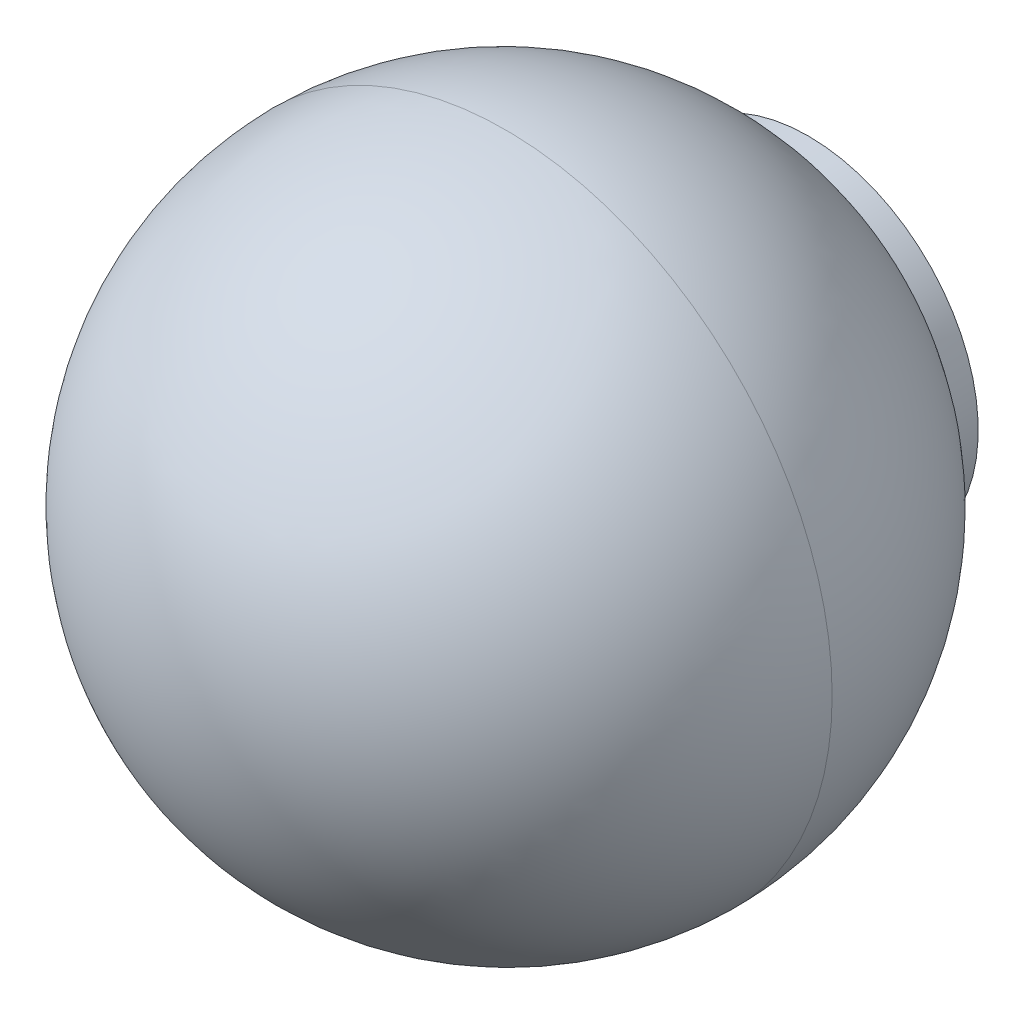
ISO-10303-21;
HEADER;
FILE_DESCRIPTION(('STEP AP214'),'2;1');
FILE_NAME('part.step','',(''),(''),'','','');
FILE_SCHEMA(('AUTOMOTIVE_DESIGN { 1 0 10303 214 1 1 1 1 }'));
ENDSEC;
DATA;
#1=APPLICATION_CONTEXT('core data for automotive mechanical design processes');
#2=APPLICATION_PROTOCOL_DEFINITION('international standard','automotive_design',2000,#1);
#3=PRODUCT_CONTEXT('',#1,'mechanical');
#4=PRODUCT('Part','Part','',(#3));
#5=PRODUCT_RELATED_PRODUCT_CATEGORY('part','',(#4));
#6=PRODUCT_DEFINITION_FORMATION('','',#4);
#7=PRODUCT_DEFINITION_CONTEXT('part definition',#1,'design');
#8=PRODUCT_DEFINITION('design','',#6,#7);
#9=PRODUCT_DEFINITION_SHAPE('','',#8);
#10=(LENGTH_UNIT() NAMED_UNIT(*) SI_UNIT(.MILLI.,.METRE.));
#11=(NAMED_UNIT(*) PLANE_ANGLE_UNIT() SI_UNIT($,.RADIAN.));
#12=(NAMED_UNIT(*) SI_UNIT($,.STERADIAN.) SOLID_ANGLE_UNIT());
#13=UNCERTAINTY_MEASURE_WITH_UNIT(LENGTH_MEASURE(1.E-05),#10,'distance_accuracy_value','');
#14=(GEOMETRIC_REPRESENTATION_CONTEXT(3) GLOBAL_UNCERTAINTY_ASSIGNED_CONTEXT((#13)) GLOBAL_UNIT_ASSIGNED_CONTEXT((#10,
#11,#12)) REPRESENTATION_CONTEXT('',''));
#15=CARTESIAN_POINT('',(0.,0.,0.));
#16=DIRECTION('',(0.,0.,1.));
#17=DIRECTION('',(1.,0.,0.));
#18=AXIS2_PLACEMENT_3D('',#15,#16,#17);
#19=CARTESIAN_POINT('',(0.,0.,23.));
#20=DIRECTION('',(0.,0.,-1.));
#21=DIRECTION('',(1.,0.,0.));
#22=AXIS2_PLACEMENT_3D('',#19,#20,#21);
#23=SPHERICAL_SURFACE('',#22,25.);
#24=CARTESIAN_POINT('',(0.,0.,23.1770782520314));
#25=DIRECTION('',(0.,0.,-1.));
#26=DIRECTION('',(0.,1.,0.));
#27=AXIS2_PLACEMENT_3D('',#24,#25,#26);
#28=CIRCLE('',#27,24.999372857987);
#29=CARTESIAN_POINT('',(24.999372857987,0.,23.1770782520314));
#30=VERTEX_POINT('',#29);
#31=EDGE_CURVE('E22',#30,#30,#28,.T.);
#32=ORIENTED_EDGE('',*,*,#31,.F.);
#33=EDGE_LOOP('',(#32));
#34=FACE_BOUND('',#33,.T.);
#35=ADVANCED_FACE('F12',(#34),#23,.T.);
#36=CARTESIAN_POINT('',(0.,0.,0.));
#37=DIRECTION('',(0.,0.,-1.));
#38=DIRECTION('',(0.,1.,0.));
#39=AXIS2_PLACEMENT_3D('',#36,#37,#38);
#40=PLANE('',#39);
#41=CARTESIAN_POINT('',(0.,0.,0.));
#42=DIRECTION('',(0.,0.,-1.));
#43=DIRECTION('',(0.,1.,0.));
#44=AXIS2_PLACEMENT_3D('',#41,#42,#43);
#45=CIRCLE('',#44,8.);
#46=CARTESIAN_POINT('',(0.,8.,0.));
#47=VERTEX_POINT('',#46);
#48=EDGE_CURVE('E31',#47,#47,#45,.T.);
#49=ORIENTED_EDGE('',*,*,#48,.F.);
#50=EDGE_LOOP('',(#49));
#51=FACE_BOUND('',#50,.T.);
#52=CARTESIAN_POINT('',(0.,0.,0.));
#53=DIRECTION('',(0.,0.,-1.));
#54=DIRECTION('',(0.,1.,0.));
#55=AXIS2_PLACEMENT_3D('',#52,#53,#54);
#56=CIRCLE('',#55,13.);
#57=CARTESIAN_POINT('',(0.,13.,0.));
#58=VERTEX_POINT('',#57);
#59=EDGE_CURVE('E8',#58,#58,#56,.T.);
#60=ORIENTED_EDGE('',*,*,#59,.T.);
#61=EDGE_LOOP('',(#60));
#62=FACE_BOUND('',#61,.T.);
#63=ADVANCED_FACE('F37',(#51,#62),#40,.T.);
#64=CARTESIAN_POINT('',(0.,0.,0.));
#65=DIRECTION('',(0.,0.,-1.));
#66=DIRECTION('',(0.,1.,0.));
#67=AXIS2_PLACEMENT_3D('',#64,#65,#66);
#68=CYLINDRICAL_SURFACE('',#67,13.);
#69=CARTESIAN_POINT('',(0.,0.,2.));
#70=DIRECTION('',(0.,0.,-1.));
#71=DIRECTION('',(0.,1.,0.));
#72=AXIS2_PLACEMENT_3D('',#69,#70,#71);
#73=CIRCLE('',#72,13.);
#74=CARTESIAN_POINT('',(13.,0.,2.));
#75=VERTEX_POINT('',#74);
#76=EDGE_CURVE('E18',#75,#75,#73,.T.);
#77=ORIENTED_EDGE('',*,*,#76,.T.);
#78=EDGE_LOOP('',(#77));
#79=FACE_BOUND('',#78,.T.);
#80=ORIENTED_EDGE('',*,*,#59,.F.);
#81=EDGE_LOOP('',(#80));
#82=FACE_BOUND('',#81,.T.);
#83=ADVANCED_FACE('F39',(#79,#82),#68,.T.);
#84=CARTESIAN_POINT('',(0.,0.,23.3541565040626));
#85=DIRECTION('',(0.,0.,-1.));
#86=DIRECTION('',(1.,0.,0.));
#87=AXIS2_PLACEMENT_3D('',#84,#85,#86);
#88=SPHERICAL_SURFACE('',#87,25.);
#89=CARTESIAN_POINT('',(24.999372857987,0.,23.1770782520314));
#90=CARTESIAN_POINT('',(24.997498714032,0.,22.9122769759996));
#91=CARTESIAN_POINT('',(24.9914142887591,0.,22.6475056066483));
#92=CARTESIAN_POINT('',(24.9708377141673,0.,22.1182897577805));
#93=CARTESIAN_POINT('',(24.9563455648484,0.,21.853845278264));
#94=CARTESIAN_POINT('',(24.9189663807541,0.,21.3255502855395));
#95=CARTESIAN_POINT('',(24.8960793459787,0.,21.0616997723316));
#96=CARTESIAN_POINT('',(24.841933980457,0.,20.5348591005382));
#97=CARTESIAN_POINT('',(24.8106756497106,0.,20.2718689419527));
#98=CARTESIAN_POINT('',(24.7398191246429,0.,19.7470145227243));
#99=CARTESIAN_POINT('',(24.7002209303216,0.,19.4851502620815));
#100=CARTESIAN_POINT('',(24.6127246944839,0.,18.962812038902));
#101=CARTESIAN_POINT('',(24.5648266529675,0.,18.7023380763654));
#102=CARTESIAN_POINT('',(24.4607790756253,0.,18.1830434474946));
#103=CARTESIAN_POINT('',(24.4046295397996,0.,17.9242227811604));
#104=CARTESIAN_POINT('',(24.2841356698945,0.,17.4084960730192));
#105=CARTESIAN_POINT('',(24.219791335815,0.,17.1515900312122));
#106=CARTESIAN_POINT('',(24.0829728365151,0.,16.6399519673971));
#107=CARTESIAN_POINT('',(24.0104986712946,0.,16.385219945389));
#108=CARTESIAN_POINT('',(23.8574936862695,0.,15.8781871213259));
#109=CARTESIAN_POINT('',(23.7769628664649,0.,15.625886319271));
#110=CARTESIAN_POINT('',(23.6079258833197,0.,15.1239706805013));
#111=CARTESIAN_POINT('',(23.5194197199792,0.,14.8743558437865));
#112=CARTESIAN_POINT('',(23.3345214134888,0.,14.3780641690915));
#113=CARTESIAN_POINT('',(23.2381292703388,0.,14.1313873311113));
#114=CARTESIAN_POINT('',(23.0375563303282,0.,13.6412207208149));
#115=CARTESIAN_POINT('',(22.9333755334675,0.,13.3977309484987));
#116=CARTESIAN_POINT('',(22.7173304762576,0.,12.9141843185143));
#117=CARTESIAN_POINT('',(22.6054662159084,0.,12.6741274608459));
#118=CARTESIAN_POINT('',(22.3741671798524,0.,12.1976890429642));
#119=CARTESIAN_POINT('',(22.2547324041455,0.,11.9613074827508));
#120=CARTESIAN_POINT('',(22.0084129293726,0.,11.492458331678));
#121=CARTESIAN_POINT('',(21.8815282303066,0.,11.2599907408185));
#122=CARTESIAN_POINT('',(21.6204370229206,0.,10.7992042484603));
#123=CARTESIAN_POINT('',(21.4862305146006,0.,10.5708853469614));
#124=CARTESIAN_POINT('',(21.2106311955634,0.,10.1186267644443));
#125=CARTESIAN_POINT('',(21.0692383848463,0.,9.89468708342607));
#126=CARTESIAN_POINT('',(20.779409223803,0.,9.45141305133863));
#127=CARTESIAN_POINT('',(20.6309728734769,0.,9.23207870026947));
#128=CARTESIAN_POINT('',(20.3272065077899,0.,8.79823678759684));
#129=CARTESIAN_POINT('',(20.1718764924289,0.,8.58372922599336));
#130=CARTESIAN_POINT('',(19.8544796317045,0.,8.15975747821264));
#131=CARTESIAN_POINT('',(19.692412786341,0.,7.95029329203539));
#132=CARTESIAN_POINT('',(19.3617059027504,0.,7.53661978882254));
#133=CARTESIAN_POINT('',(19.1930658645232,0.,7.33241047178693));
#134=CARTESIAN_POINT('',(18.8493828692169,0.,6.9294528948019));
#135=CARTESIAN_POINT('',(18.6743399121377,0.,6.73070463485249));
#136=CARTESIAN_POINT('',(18.3180278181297,0.,6.33886984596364));
#137=CARTESIAN_POINT('',(18.136758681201,0.,6.14578331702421));
#138=CARTESIAN_POINT('',(17.7681772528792,0.,5.76546694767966));
#139=CARTESIAN_POINT('',(17.5808649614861,0.,5.57823710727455));
#140=CARTESIAN_POINT('',(17.2003863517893,0.,5.20982315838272));
#141=CARTESIAN_POINT('',(17.0072200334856,0.,5.02863904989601));
#142=CARTESIAN_POINT('',(16.6152284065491,0.,4.67249950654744));
#143=CARTESIAN_POINT('',(16.4164030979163,0.,4.49754407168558));
#144=CARTESIAN_POINT('',(16.0132942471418,0.,4.15403851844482));
#145=CARTESIAN_POINT('',(15.809010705,0.,3.98548840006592));
#146=CARTESIAN_POINT('',(15.3951916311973,0.,3.6549636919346));
#147=CARTESIAN_POINT('',(15.1856560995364,0.,3.49298910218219));
#148=CARTESIAN_POINT('',(14.7615446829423,0.,3.17577888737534));
#149=CARTESIAN_POINT('',(14.5469687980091,0.,3.0205432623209));
#150=CARTESIAN_POINT('',(14.1129930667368,0.,2.7169681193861));
#151=CARTESIAN_POINT('',(13.8935932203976,0.,2.56862860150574));
#152=CARTESIAN_POINT('',(13.4501920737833,0.,2.27899394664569));
#153=CARTESIAN_POINT('',(13.2261907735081,0.,2.13769880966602));
#154=CARTESIAN_POINT('',(13.,0.,2.));
#155=B_SPLINE_CURVE_WITH_KNOTS('',3,(#89,#90,#91,#92,#93,#94,#95,#96,#97,#98,#99,#100,#101,#102,
#103,#104,#105,#106,#107,#108,#109,#110,#111,#112,#113,#114,#115,#116,#117,#118,#119,#120,#121,
#122,#123,#124,#125,#126,#127,#128,#129,#130,#131,#132,#133,#134,#135,#136,#137,#138,#139,#140,
#141,#142,#143,#144,#145,#146,#147,#148,#149,#150,#151,#152,#153,#154),.UNSPECIFIED.,.F.,.F.,(4,
2,2,2,2,2,2,2,2,2,2,2,2,2,2,2,2,2,2,2,2,2,2,2,2,2,2,2,2,2,2,2,4),(0.,0.794390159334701,
1.5887803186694,2.3831704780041,3.17756063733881,3.97195079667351,4.76634095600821,
5.56073111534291,6.35512127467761,7.14951143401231,7.94390159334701,8.73829175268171,
9.53268191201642,10.3270720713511,11.1214622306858,11.9158523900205,12.7102425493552,
13.5046327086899,14.2990228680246,15.0934130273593,15.887803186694,16.6821933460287,
17.4765835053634,18.2709736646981,19.0653638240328,19.8597539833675,20.6541441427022,
21.4485343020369,22.2429244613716,23.0373146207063,23.831704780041,24.6260949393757,
25.4204850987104),.UNSPECIFIED.);
#156=EDGE_CURVE('BSEAM46',#30,#75,#155,.T.);
#157=ORIENTED_EDGE('',*,*,#31,.T.);
#158=ORIENTED_EDGE('',*,*,#76,.F.);
#159=ORIENTED_EDGE('',*,*,#156,.T.);
#160=ORIENTED_EDGE('',*,*,#156,.F.);
#161=EDGE_LOOP('',(#157,#159,#158,#160));
#162=FACE_BOUND('',#161,.T.);
#163=ADVANCED_FACE('F46',(#162),#88,.T.);
#164=CARTESIAN_POINT('',(0.,0.,25.));
#165=DIRECTION('',(0.,0.,-1.));
#166=DIRECTION('',(0.,1.,0.));
#167=AXIS2_PLACEMENT_3D('',#164,#165,#166);
#168=CYLINDRICAL_SURFACE('',#167,8.);
#169=CARTESIAN_POINT('',(0.,0.,25.));
#170=DIRECTION('',(0.,0.,-1.));
#171=DIRECTION('',(0.,1.,0.));
#172=AXIS2_PLACEMENT_3D('',#169,#170,#171);
#173=CIRCLE('',#172,8.);
#174=CARTESIAN_POINT('',(0.,8.,25.));
#175=VERTEX_POINT('',#174);
#176=EDGE_CURVE('E26',#175,#175,#173,.T.);
#177=ORIENTED_EDGE('',*,*,#176,.F.);
#178=EDGE_LOOP('',(#177));
#179=FACE_BOUND('',#178,.T.);
#180=ORIENTED_EDGE('',*,*,#48,.T.);
#181=EDGE_LOOP('',(#180));
#182=FACE_BOUND('',#181,.T.);
#183=ADVANCED_FACE('F35',(#179,#182),#168,.F.);
#184=CARTESIAN_POINT('',(0.,0.,25.));
#185=DIRECTION('',(0.,0.,-1.));
#186=DIRECTION('',(0.,1.,0.));
#187=AXIS2_PLACEMENT_3D('',#184,#185,#186);
#188=PLANE('',#187);
#189=ORIENTED_EDGE('',*,*,#176,.T.);
#190=EDGE_LOOP('',(#189));
#191=FACE_BOUND('',#190,.T.);
#192=ADVANCED_FACE('F55',(#191),#188,.T.);
#193=CLOSED_SHELL('',(#35,#63,#83,#163,#183,#192));
#194=MANIFOLD_SOLID_BREP('B1',#193);
#195=ADVANCED_BREP_SHAPE_REPRESENTATION('',(#18,#194),#14);
#196=SHAPE_DEFINITION_REPRESENTATION(#9,#195);
ENDSEC;
END-ISO-10303-21;
